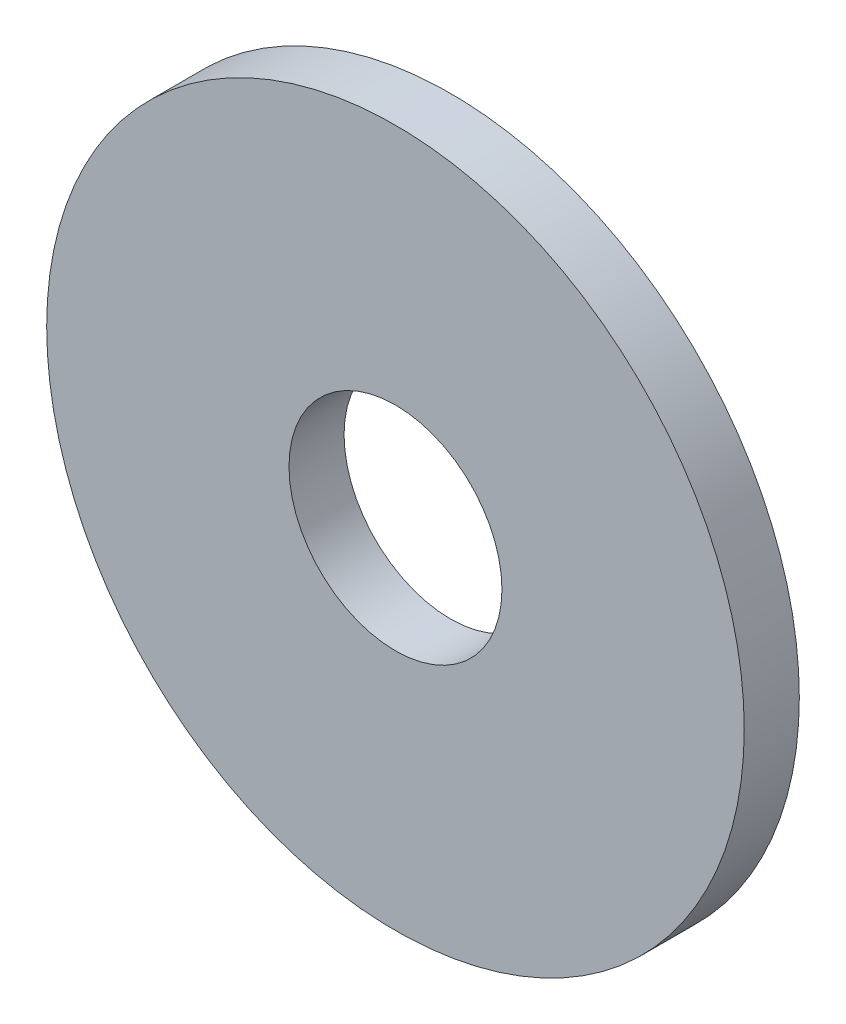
from build123d import *

# Parameters (mm, degrees)
SKETCH1_R             = 4.826
BOSS_EXTRUDE1_DEPTH   = 0.762
F_4_CLEARANCE_HOLE1_D = 2.9464


with BuildPart() as part:
    # Sketch1 → Boss-Extrude1 (new body)
    with BuildSketch(Plane.XY):
        with Locations(Location((0, 0, 0), (0, 0, 180))):
            Circle(SKETCH1_R)
    extrude(amount=BOSS_EXTRUDE1_DEPTH)

    # 4 Clearance Hole1 (through all)
    with Locations(Plane.XY.offset(0.762)):
        with Locations((0, 0)):
            Hole(F_4_CLEARANCE_HOLE1_D / 2)


solid = part.part
